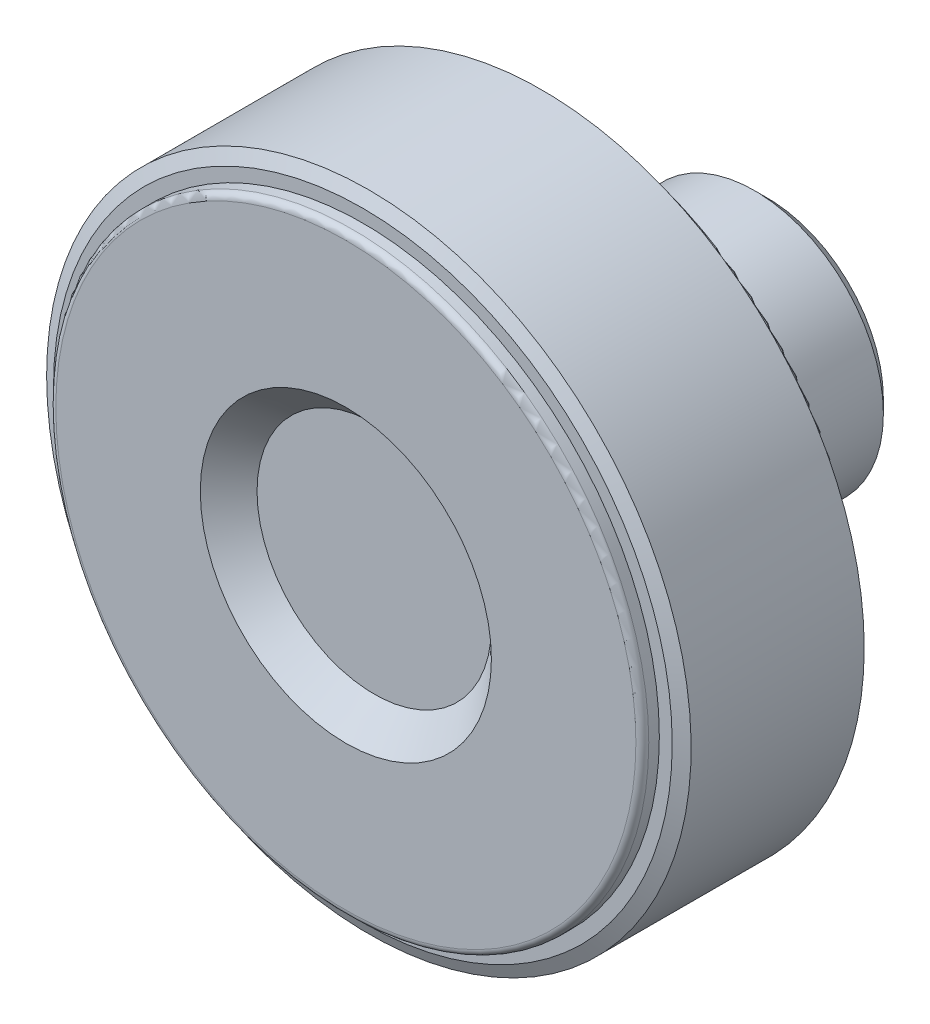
ISO-10303-21;
HEADER;
FILE_DESCRIPTION(('STEP AP214'),'2;1');
FILE_NAME('part.step','',(''),(''),'','','');
FILE_SCHEMA(('AUTOMOTIVE_DESIGN { 1 0 10303 214 1 1 1 1 }'));
ENDSEC;
DATA;
#1=APPLICATION_CONTEXT('core data for automotive mechanical design processes');
#2=APPLICATION_PROTOCOL_DEFINITION('international standard','automotive_design',2000,#1);
#3=PRODUCT_CONTEXT('',#1,'mechanical');
#4=PRODUCT('Part','Part','',(#3));
#5=PRODUCT_RELATED_PRODUCT_CATEGORY('part','',(#4));
#6=PRODUCT_DEFINITION_FORMATION('','',#4);
#7=PRODUCT_DEFINITION_CONTEXT('part definition',#1,'design');
#8=PRODUCT_DEFINITION('design','',#6,#7);
#9=PRODUCT_DEFINITION_SHAPE('','',#8);
#10=(LENGTH_UNIT() NAMED_UNIT(*) SI_UNIT(.MILLI.,.METRE.));
#11=(NAMED_UNIT(*) PLANE_ANGLE_UNIT() SI_UNIT($,.RADIAN.));
#12=(NAMED_UNIT(*) SI_UNIT($,.STERADIAN.) SOLID_ANGLE_UNIT());
#13=UNCERTAINTY_MEASURE_WITH_UNIT(LENGTH_MEASURE(1.E-05),#10,'distance_accuracy_value','');
#14=(GEOMETRIC_REPRESENTATION_CONTEXT(3) GLOBAL_UNCERTAINTY_ASSIGNED_CONTEXT((#13)) GLOBAL_UNIT_ASSIGNED_CONTEXT((#10,
#11,#12)) REPRESENTATION_CONTEXT('',''));
#15=CARTESIAN_POINT('',(0.,0.,0.));
#16=DIRECTION('',(0.,0.,1.));
#17=DIRECTION('',(1.,0.,0.));
#18=AXIS2_PLACEMENT_3D('',#15,#16,#17);
#19=CARTESIAN_POINT('',(0.,2.66666666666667,0.));
#20=DIRECTION('',(0.,0.,-1.));
#21=DIRECTION('',(-1.,0.,0.));
#22=AXIS2_PLACEMENT_3D('',#19,#20,#21);
#23=PLANE('',#22);
#24=CARTESIAN_POINT('',(0.,0.,0.));
#25=DIRECTION('',(0.,0.,-1.));
#26=DIRECTION('',(-1.,0.,0.));
#27=AXIS2_PLACEMENT_3D('',#24,#25,#26);
#28=CIRCLE('',#27,4.49999999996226);
#29=CARTESIAN_POINT('',(-4.49999999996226,0.,0.));
#30=VERTEX_POINT('',#29);
#31=EDGE_CURVE('E9',#30,#30,#28,.F.);
#32=ORIENTED_EDGE('',*,*,#31,.T.);
#33=EDGE_LOOP('',(#32));
#34=FACE_BOUND('',#33,.T.);
#35=CARTESIAN_POINT('',(0.,0.,0.));
#36=DIRECTION('',(0.,0.,1.));
#37=DIRECTION('',(1.,0.,0.));
#38=AXIS2_PLACEMENT_3D('',#35,#36,#37);
#39=CIRCLE('',#38,5.33333333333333);
#40=CARTESIAN_POINT('',(5.33333333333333,0.,0.));
#41=VERTEX_POINT('',#40);
#42=EDGE_CURVE('E211',#41,#41,#39,.T.);
#43=ORIENTED_EDGE('',*,*,#42,.F.);
#44=EDGE_LOOP('',(#43));
#45=FACE_BOUND('',#44,.T.);
#46=ADVANCED_FACE('F14',(#34,#45),#23,.T.);
#47=CARTESIAN_POINT('',(0.,0.,0.15));
#48=DIRECTION('',(0.,0.,1.));
#49=DIRECTION('',(1.,0.,0.));
#50=AXIS2_PLACEMENT_3D('',#47,#48,#49);
#51=CYLINDRICAL_SURFACE('',#50,5.33333333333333);
#52=ORIENTED_EDGE('',*,*,#42,.T.);
#53=EDGE_LOOP('',(#52));
#54=FACE_BOUND('',#53,.T.);
#55=CARTESIAN_POINT('',(0.,0.,0.3));
#56=DIRECTION('',(0.,0.,1.));
#57=DIRECTION('',(1.,0.,0.));
#58=AXIS2_PLACEMENT_3D('',#55,#56,#57);
#59=CIRCLE('',#58,5.33333333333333);
#60=CARTESIAN_POINT('',(5.33333333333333,0.,0.3));
#61=VERTEX_POINT('',#60);
#62=EDGE_CURVE('E208',#61,#61,#59,.T.);
#63=ORIENTED_EDGE('',*,*,#62,.F.);
#64=EDGE_LOOP('',(#63));
#65=FACE_BOUND('',#64,.T.);
#66=ADVANCED_FACE('F410',(#54,#65),#51,.T.);
#67=CARTESIAN_POINT('',(0.,7.16666666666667,0.3));
#68=DIRECTION('',(0.,0.,-1.));
#69=DIRECTION('',(-1.,0.,0.));
#70=AXIS2_PLACEMENT_3D('',#67,#68,#69);
#71=PLANE('',#70);
#72=CARTESIAN_POINT('',(0.,0.,0.3));
#73=DIRECTION('',(0.,0.,1.));
#74=DIRECTION('',(1.,0.,0.));
#75=AXIS2_PLACEMENT_3D('',#72,#73,#74);
#76=CIRCLE('',#75,9.);
#77=CARTESIAN_POINT('',(9.,0.,0.3));
#78=VERTEX_POINT('',#77);
#79=EDGE_CURVE('E177',#78,#78,#76,.T.);
#80=ORIENTED_EDGE('',*,*,#79,.F.);
#81=EDGE_LOOP('',(#80));
#82=FACE_BOUND('',#81,.T.);
#83=ORIENTED_EDGE('',*,*,#62,.T.);
#84=EDGE_LOOP('',(#83));
#85=FACE_BOUND('',#84,.T.);
#86=ADVANCED_FACE('F415',(#82,#85),#71,.T.);
#87=CARTESIAN_POINT('',(0.,0.,1.3));
#88=DIRECTION('',(0.,0.,1.));
#89=DIRECTION('',(1.,0.,0.));
#90=AXIS2_PLACEMENT_3D('',#87,#88,#89);
#91=CONICAL_SURFACE('',#90,10.,0.785398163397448);
#92=ORIENTED_EDGE('',*,*,#79,.T.);
#93=EDGE_LOOP('',(#92));
#94=FACE_BOUND('',#93,.T.);
#95=CARTESIAN_POINT('',(0.,0.,1.3));
#96=DIRECTION('',(0.,0.,1.));
#97=DIRECTION('',(1.,0.,0.));
#98=AXIS2_PLACEMENT_3D('',#95,#96,#97);
#99=CIRCLE('',#98,10.);
#100=CARTESIAN_POINT('',(10.,0.,1.3));
#101=VERTEX_POINT('',#100);
#102=EDGE_CURVE('E174',#101,#101,#99,.T.);
#103=ORIENTED_EDGE('',*,*,#102,.F.);
#104=EDGE_LOOP('',(#103));
#105=FACE_BOUND('',#104,.T.);
#106=ADVANCED_FACE('F420',(#94,#105),#91,.T.);
#107=CARTESIAN_POINT('',(0.,0.,13.9));
#108=DIRECTION('',(0.,0.,1.));
#109=DIRECTION('',(1.,0.,0.));
#110=AXIS2_PLACEMENT_3D('',#107,#108,#109);
#111=CYLINDRICAL_SURFACE('',#110,10.);
#112=ORIENTED_EDGE('',*,*,#102,.T.);
#113=EDGE_LOOP('',(#112));
#114=FACE_BOUND('',#113,.T.);
#115=CARTESIAN_POINT('',(0.,0.,26.5));
#116=DIRECTION('',(0.,0.,-1.));
#117=DIRECTION('',(-1.,0.,0.));
#118=AXIS2_PLACEMENT_3D('',#115,#116,#117);
#119=CIRCLE('',#118,10.);
#120=CARTESIAN_POINT('',(-10.,0.,26.5));
#121=VERTEX_POINT('',#120);
#122=EDGE_CURVE('E77',#121,#121,#119,.T.);
#123=ORIENTED_EDGE('',*,*,#122,.T.);
#124=EDGE_LOOP('',(#123));
#125=FACE_BOUND('',#124,.T.);
#126=ADVANCED_FACE('F427',(#114,#125),#111,.T.);
#127=CARTESIAN_POINT('',(0.,0.,26.5));
#128=DIRECTION('',(0.,0.,-1.));
#129=DIRECTION('',(-1.,0.,0.));
#130=AXIS2_PLACEMENT_3D('',#127,#128,#129);
#131=TOROIDAL_SURFACE('',#130,11.,1.);
#132=CARTESIAN_POINT('',(0.,0.,27.5));
#133=DIRECTION('',(0.,0.,-1.));
#134=DIRECTION('',(1.,0.,0.));
#135=AXIS2_PLACEMENT_3D('',#132,#133,#134);
#136=CIRCLE('',#135,11.);
#137=CARTESIAN_POINT('',(-11.,0.,27.5));
#138=VERTEX_POINT('',#137);
#139=CARTESIAN_POINT('',(11.,0.,27.5));
#140=VERTEX_POINT('',#139);
#141=EDGE_CURVE('E70',#138,#140,#136,.F.);
#142=ORIENTED_EDGE('',*,*,#141,.F.);
#143=CARTESIAN_POINT('',(0.,0.,27.5));
#144=DIRECTION('',(0.,0.,-1.));
#145=DIRECTION('',(-1.,0.,0.));
#146=AXIS2_PLACEMENT_3D('',#143,#144,#145);
#147=CIRCLE('',#146,11.);
#148=CARTESIAN_POINT('',(0.,11.,27.5));
#149=VERTEX_POINT('',#148);
#150=EDGE_CURVE('E73',#149,#138,#147,.F.);
#151=ORIENTED_EDGE('',*,*,#150,.F.);
#152=CARTESIAN_POINT('',(0.,0.,27.5));
#153=DIRECTION('',(0.,0.,-1.));
#154=DIRECTION('',(0.,1.,0.));
#155=AXIS2_PLACEMENT_3D('',#152,#153,#154);
#156=CIRCLE('',#155,11.);
#157=EDGE_CURVE('E65',#140,#149,#156,.F.);
#158=ORIENTED_EDGE('',*,*,#157,.F.);
#159=EDGE_LOOP('',(#142,#151,#158));
#160=FACE_BOUND('',#159,.T.);
#161=ORIENTED_EDGE('',*,*,#122,.F.);
#162=EDGE_LOOP('',(#161));
#163=FACE_BOUND('',#162,.T.);
#164=ADVANCED_FACE('F68',(#160,#163),#131,.F.);
#165=CARTESIAN_POINT('',(0.,14.6153846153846,27.5));
#166=DIRECTION('',(0.,0.,-1.));
#167=DIRECTION('',(-1.,0.,0.));
#168=AXIS2_PLACEMENT_3D('',#165,#166,#167);
#169=PLANE('',#168);
#170=CARTESIAN_POINT('',(0.,0.,27.5));
#171=DIRECTION('',(0.,0.,1.));
#172=DIRECTION('',(-1.,0.,0.));
#173=AXIS2_PLACEMENT_3D('',#170,#171,#172);
#174=CIRCLE('',#173,18.2307692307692);
#175=CARTESIAN_POINT('',(18.2307692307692,0.,27.5));
#176=VERTEX_POINT('',#175);
#177=CARTESIAN_POINT('',(-18.2307692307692,0.,27.5));
#178=VERTEX_POINT('',#177);
#179=EDGE_CURVE('E83',#176,#178,#174,.F.);
#180=ORIENTED_EDGE('',*,*,#179,.T.);
#181=CARTESIAN_POINT('',(0.,0.,27.5));
#182=DIRECTION('',(0.,0.,1.));
#183=DIRECTION('',(0.,1.,0.));
#184=AXIS2_PLACEMENT_3D('',#181,#182,#183);
#185=CIRCLE('',#184,18.2307692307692);
#186=CARTESIAN_POINT('',(0.,18.2307692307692,27.5));
#187=VERTEX_POINT('',#186);
#188=EDGE_CURVE('E132',#178,#187,#185,.F.);
#189=ORIENTED_EDGE('',*,*,#188,.T.);
#190=CARTESIAN_POINT('',(0.,0.,27.5));
#191=DIRECTION('',(0.,0.,1.));
#192=DIRECTION('',(1.,0.,0.));
#193=AXIS2_PLACEMENT_3D('',#190,#191,#192);
#194=CIRCLE('',#193,18.2307692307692);
#195=EDGE_CURVE('E145',#187,#176,#194,.F.);
#196=ORIENTED_EDGE('',*,*,#195,.T.);
#197=EDGE_LOOP('',(#180,#189,#196));
#198=FACE_BOUND('',#197,.T.);
#199=ORIENTED_EDGE('',*,*,#150,.T.);
#200=ORIENTED_EDGE('',*,*,#141,.T.);
#201=ORIENTED_EDGE('',*,*,#157,.T.);
#202=EDGE_LOOP('',(#199,#200,#201));
#203=FACE_BOUND('',#202,.T.);
#204=ADVANCED_FACE('F81',(#198,#203),#169,.T.);
#205=CARTESIAN_POINT('',(0.,0.,26.5));
#206=DIRECTION('',(0.,0.,-1.));
#207=DIRECTION('',(-1.,0.,0.));
#208=AXIS2_PLACEMENT_3D('',#205,#206,#207);
#209=TOROIDAL_SURFACE('',#208,18.2307692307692,1.);
#210=ORIENTED_EDGE('',*,*,#188,.F.);
#211=ORIENTED_EDGE('',*,*,#179,.F.);
#212=ORIENTED_EDGE('',*,*,#195,.F.);
#213=EDGE_LOOP('',(#210,#211,#212));
#214=FACE_BOUND('',#213,.T.);
#215=CARTESIAN_POINT('',(0.,0.,26.5));
#216=DIRECTION('',(0.,0.,1.));
#217=DIRECTION('',(1.,0.,0.));
#218=AXIS2_PLACEMENT_3D('',#215,#216,#217);
#219=CIRCLE('',#218,19.2307692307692);
#220=CARTESIAN_POINT('',(19.2307692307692,0.,26.5));
#221=VERTEX_POINT('',#220);
#222=EDGE_CURVE('E205',#221,#221,#219,.F.);
#223=ORIENTED_EDGE('',*,*,#222,.T.);
#224=EDGE_LOOP('',(#223));
#225=FACE_BOUND('',#224,.T.);
#226=ADVANCED_FACE('F102',(#214,#225),#209,.F.);
#227=CARTESIAN_POINT('',(0.,0.,21.25));
#228=DIRECTION('',(0.,0.,1.));
#229=DIRECTION('',(1.,0.,0.));
#230=AXIS2_PLACEMENT_3D('',#227,#228,#229);
#231=CYLINDRICAL_SURFACE('',#230,19.2307692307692);
#232=ORIENTED_EDGE('',*,*,#222,.F.);
#233=EDGE_LOOP('',(#232));
#234=FACE_BOUND('',#233,.T.);
#235=CARTESIAN_POINT('',(0.,0.,16.));
#236=DIRECTION('',(0.,0.,1.));
#237=DIRECTION('',(1.,0.,0.));
#238=AXIS2_PLACEMENT_3D('',#235,#236,#237);
#239=CIRCLE('',#238,19.2307692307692);
#240=CARTESIAN_POINT('',(19.2307692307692,0.,16.));
#241=VERTEX_POINT('',#240);
#242=EDGE_CURVE('E201',#241,#241,#239,.T.);
#243=ORIENTED_EDGE('',*,*,#242,.F.);
#244=EDGE_LOOP('',(#243));
#245=FACE_BOUND('',#244,.T.);
#246=ADVANCED_FACE('F326',(#234,#245),#231,.F.);
#247=CARTESIAN_POINT('',(0.,20.8653846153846,16.));
#248=DIRECTION('',(0.,0.,-1.));
#249=DIRECTION('',(-1.,0.,0.));
#250=AXIS2_PLACEMENT_3D('',#247,#248,#249);
#251=PLANE('',#250);
#252=CARTESIAN_POINT('',(0.,0.,16.));
#253=DIRECTION('',(0.,0.,1.));
#254=DIRECTION('',(-1.,0.,0.));
#255=AXIS2_PLACEMENT_3D('',#252,#253,#254);
#256=CIRCLE('',#255,22.5);
#257=CARTESIAN_POINT('',(-22.5,0.,16.));
#258=VERTEX_POINT('',#257);
#259=CARTESIAN_POINT('',(22.5,0.,16.));
#260=VERTEX_POINT('',#259);
#261=EDGE_CURVE('E261',#258,#260,#256,.T.);
#262=ORIENTED_EDGE('',*,*,#261,.F.);
#263=CARTESIAN_POINT('',(0.,0.,16.));
#264=DIRECTION('',(0.,0.,1.));
#265=DIRECTION('',(0.,1.,0.));
#266=AXIS2_PLACEMENT_3D('',#263,#264,#265);
#267=CIRCLE('',#266,22.5);
#268=CARTESIAN_POINT('',(0.,22.5,16.));
#269=VERTEX_POINT('',#268);
#270=EDGE_CURVE('E296',#269,#258,#267,.T.);
#271=ORIENTED_EDGE('',*,*,#270,.F.);
#272=CARTESIAN_POINT('',(0.,0.,16.));
#273=DIRECTION('',(0.,0.,1.));
#274=DIRECTION('',(1.,0.,0.));
#275=AXIS2_PLACEMENT_3D('',#272,#273,#274);
#276=CIRCLE('',#275,22.5);
#277=EDGE_CURVE('E204',#260,#269,#276,.T.);
#278=ORIENTED_EDGE('',*,*,#277,.F.);
#279=EDGE_LOOP('',(#262,#271,#278));
#280=FACE_BOUND('',#279,.T.);
#281=ORIENTED_EDGE('',*,*,#242,.T.);
#282=EDGE_LOOP('',(#281));
#283=FACE_BOUND('',#282,.T.);
#284=ADVANCED_FACE('F272',(#280,#283),#251,.T.);
#285=CARTESIAN_POINT('',(0.,0.,16.5));
#286=DIRECTION('',(0.,0.,-1.));
#287=DIRECTION('',(-1.,0.,0.));
#288=AXIS2_PLACEMENT_3D('',#285,#286,#287);
#289=TOROIDAL_SURFACE('',#288,22.5,0.5);
#290=ORIENTED_EDGE('',*,*,#270,.T.);
#291=ORIENTED_EDGE('',*,*,#261,.T.);
#292=ORIENTED_EDGE('',*,*,#277,.T.);
#293=EDGE_LOOP('',(#290,#291,#292));
#294=FACE_BOUND('',#293,.T.);
#295=CARTESIAN_POINT('',(0.,0.,16.5));
#296=DIRECTION('',(0.,0.,1.));
#297=DIRECTION('',(1.,0.,0.));
#298=AXIS2_PLACEMENT_3D('',#295,#296,#297);
#299=CIRCLE('',#298,23.);
#300=CARTESIAN_POINT('',(23.,0.,16.5));
#301=VERTEX_POINT('',#300);
#302=EDGE_CURVE('E200',#301,#301,#299,.T.);
#303=ORIENTED_EDGE('',*,*,#302,.F.);
#304=EDGE_LOOP('',(#303));
#305=FACE_BOUND('',#304,.T.);
#306=ADVANCED_FACE('F266',(#294,#305),#289,.T.);
#307=CARTESIAN_POINT('',(0.,0.,16.91));
#308=DIRECTION('',(0.,0.,1.));
#309=DIRECTION('',(1.,0.,0.));
#310=AXIS2_PLACEMENT_3D('',#307,#308,#309);
#311=CYLINDRICAL_SURFACE('',#310,23.);
#312=ORIENTED_EDGE('',*,*,#302,.T.);
#313=EDGE_LOOP('',(#312));
#314=FACE_BOUND('',#313,.T.);
#315=CARTESIAN_POINT('',(0.,0.,17.32));
#316=DIRECTION('',(0.,0.,1.));
#317=DIRECTION('',(1.,0.,0.));
#318=AXIS2_PLACEMENT_3D('',#315,#316,#317);
#319=CIRCLE('',#318,23.);
#320=CARTESIAN_POINT('',(23.,0.,17.32));
#321=VERTEX_POINT('',#320);
#322=EDGE_CURVE('E197',#321,#321,#319,.T.);
#323=ORIENTED_EDGE('',*,*,#322,.F.);
#324=EDGE_LOOP('',(#323));
#325=FACE_BOUND('',#324,.T.);
#326=ADVANCED_FACE('F271',(#314,#325),#311,.T.);
#327=CARTESIAN_POINT('',(0.,23.5,17.32));
#328=DIRECTION('',(0.,0.,-1.));
#329=DIRECTION('',(-1.,0.,0.));
#330=AXIS2_PLACEMENT_3D('',#327,#328,#329);
#331=PLANE('',#330);
#332=CARTESIAN_POINT('',(0.,0.,17.32));
#333=DIRECTION('',(0.,0.,1.));
#334=DIRECTION('',(1.,0.,0.));
#335=AXIS2_PLACEMENT_3D('',#332,#333,#334);
#336=CIRCLE('',#335,24.);
#337=CARTESIAN_POINT('',(24.,0.,17.32));
#338=VERTEX_POINT('',#337);
#339=EDGE_CURVE('E193',#338,#338,#336,.T.);
#340=ORIENTED_EDGE('',*,*,#339,.F.);
#341=EDGE_LOOP('',(#340));
#342=FACE_BOUND('',#341,.T.);
#343=ORIENTED_EDGE('',*,*,#322,.T.);
#344=EDGE_LOOP('',(#343));
#345=FACE_BOUND('',#344,.T.);
#346=ADVANCED_FACE('F340',(#342,#345),#331,.T.);
#347=CARTESIAN_POINT('',(0.,0.,17.786307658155));
#348=DIRECTION('',(0.,0.,1.));
#349=DIRECTION('',(1.,0.,0.));
#350=AXIS2_PLACEMENT_3D('',#347,#348,#349);
#351=CONICAL_SURFACE('',#350,25.,1.13446401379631);
#352=CARTESIAN_POINT('',(4.86721773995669E-13,1.73372427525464E-12,17.786307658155));
#353=DIRECTION('',(0.,0.,-1.));
#354=DIRECTION('',(-1.,0.,0.));
#355=AXIS2_PLACEMENT_3D('',#352,#353,#354);
#356=CIRCLE('',#355,24.9999999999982);
#357=CARTESIAN_POINT('',(-24.9999999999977,1.73372427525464E-12,17.786307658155));
#358=VERTEX_POINT('',#357);
#359=EDGE_CURVE('E196',#358,#358,#356,.F.);
#360=ORIENTED_EDGE('',*,*,#359,.F.);
#361=EDGE_LOOP('',(#360));
#362=FACE_BOUND('',#361,.T.);
#363=ORIENTED_EDGE('',*,*,#339,.T.);
#364=EDGE_LOOP('',(#363));
#365=FACE_BOUND('',#364,.T.);
#366=ADVANCED_FACE('F337',(#362,#365),#351,.T.);
#367=CARTESIAN_POINT('',(0.,0.,20.));
#368=DIRECTION('',(0.,0.,-1.));
#369=DIRECTION('',(-1.,0.,0.));
#370=AXIS2_PLACEMENT_3D('',#367,#368,#369);
#371=PLANE('',#370);
#372=CARTESIAN_POINT('',(0.,0.,20.));
#373=DIRECTION('',(0.,0.,-1.));
#374=DIRECTION('',(-1.,0.,0.));
#375=AXIS2_PLACEMENT_3D('',#372,#373,#374);
#376=CIRCLE('',#375,3.99999999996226);
#377=CARTESIAN_POINT('',(-3.99999999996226,0.,20.));
#378=VERTEX_POINT('',#377);
#379=EDGE_CURVE('E214',#378,#378,#376,.T.);
#380=ORIENTED_EDGE('',*,*,#379,.T.);
#381=EDGE_LOOP('',(#380));
#382=FACE_BOUND('',#381,.T.);
#383=ADVANCED_FACE('F339',(#382),#371,.T.);
#384=CARTESIAN_POINT('',(0.,0.,20.));
#385=DIRECTION('',(0.,0.,-1.));
#386=DIRECTION('',(-1.,0.,0.));
#387=AXIS2_PLACEMENT_3D('',#384,#385,#386);
#388=CYLINDRICAL_SURFACE('',#387,3.99999999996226);
#389=CARTESIAN_POINT('',(0.,0.,0.500000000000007));
#390=DIRECTION('',(0.,0.,-1.));
#391=DIRECTION('',(-1.,0.,0.));
#392=AXIS2_PLACEMENT_3D('',#389,#390,#391);
#393=CIRCLE('',#392,3.99999999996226);
#394=CARTESIAN_POINT('',(-3.99999999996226,0.,0.500000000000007));
#395=VERTEX_POINT('',#394);
#396=EDGE_CURVE('E24',#395,#395,#393,.T.);
#397=ORIENTED_EDGE('',*,*,#396,.T.);
#398=EDGE_LOOP('',(#397));
#399=FACE_BOUND('',#398,.T.);
#400=ORIENTED_EDGE('',*,*,#379,.F.);
#401=EDGE_LOOP('',(#400));
#402=FACE_BOUND('',#401,.T.);
#403=ADVANCED_FACE('F348',(#399,#402),#388,.F.);
#404=CARTESIAN_POINT('',(0.,0.,0.500000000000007));
#405=DIRECTION('',(0.,0.,-1.));
#406=DIRECTION('',(-1.,0.,0.));
#407=AXIS2_PLACEMENT_3D('',#404,#405,#406);
#408=CONICAL_SURFACE('',#407,3.99999999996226,0.785398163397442);
#409=ORIENTED_EDGE('',*,*,#31,.F.);
#410=EDGE_LOOP('',(#409));
#411=FACE_BOUND('',#410,.T.);
#412=ORIENTED_EDGE('',*,*,#396,.F.);
#413=EDGE_LOOP('',(#412));
#414=FACE_BOUND('',#413,.T.);
#415=ADVANCED_FACE('F16',(#411,#414),#408,.F.);
#416=CARTESIAN_POINT('',(0.,4.54545454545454,30.8));
#417=DIRECTION('',(0.,0.,1.));
#418=DIRECTION('',(1.,0.,0.));
#419=AXIS2_PLACEMENT_3D('',#416,#417,#418);
#420=PLANE('',#419);
#421=CARTESIAN_POINT('',(0.,0.,30.8));
#422=DIRECTION('',(0.,0.,1.));
#423=DIRECTION('',(1.,0.,0.));
#424=AXIS2_PLACEMENT_3D('',#421,#422,#423);
#425=CIRCLE('',#424,9.0909090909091);
#426=CARTESIAN_POINT('',(9.0909090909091,0.,30.8));
#427=VERTEX_POINT('',#426);
#428=EDGE_CURVE('E181',#427,#427,#425,.T.);
#429=ORIENTED_EDGE('',*,*,#428,.T.);
#430=EDGE_LOOP('',(#429));
#431=FACE_BOUND('',#430,.T.);
#432=ADVANCED_FACE('F239',(#431),#420,.T.);
#433=CARTESIAN_POINT('',(0.,0.,33.));
#434=DIRECTION('',(0.,0.,1.));
#435=DIRECTION('',(1.,0.,0.));
#436=AXIS2_PLACEMENT_3D('',#433,#434,#435);
#437=CONICAL_SURFACE('',#436,11.2909090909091,0.785398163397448);
#438=CARTESIAN_POINT('',(0.,0.,33.));
#439=DIRECTION('',(0.,0.,1.));
#440=DIRECTION('',(1.,0.,0.));
#441=AXIS2_PLACEMENT_3D('',#438,#439,#440);
#442=CIRCLE('',#441,11.2909090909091);
#443=CARTESIAN_POINT('',(11.2909090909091,0.,33.));
#444=VERTEX_POINT('',#443);
#445=EDGE_CURVE('E178',#444,#444,#442,.F.);
#446=ORIENTED_EDGE('',*,*,#445,.F.);
#447=EDGE_LOOP('',(#446));
#448=FACE_BOUND('',#447,.T.);
#449=ORIENTED_EDGE('',*,*,#428,.F.);
#450=EDGE_LOOP('',(#449));
#451=FACE_BOUND('',#450,.T.);
#452=ADVANCED_FACE('F237',(#448,#451),#437,.F.);
#453=CARTESIAN_POINT('',(0.,16.8954545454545,33.));
#454=DIRECTION('',(0.,0.,1.));
#455=DIRECTION('',(1.,0.,0.));
#456=AXIS2_PLACEMENT_3D('',#453,#454,#455);
#457=PLANE('',#456);
#458=ORIENTED_EDGE('',*,*,#445,.T.);
#459=EDGE_LOOP('',(#458));
#460=FACE_BOUND('',#459,.T.);
#461=CARTESIAN_POINT('',(0.,0.,33.));
#462=DIRECTION('',(0.,0.,-1.));
#463=DIRECTION('',(-1.,0.,0.));
#464=AXIS2_PLACEMENT_3D('',#461,#462,#463);
#465=CIRCLE('',#464,22.5);
#466=CARTESIAN_POINT('',(0.,22.5,33.));
#467=VERTEX_POINT('',#466);
#468=CARTESIAN_POINT('',(-22.5,0.,33.));
#469=VERTEX_POINT('',#468);
#470=EDGE_CURVE('E216',#467,#469,#465,.F.);
#471=ORIENTED_EDGE('',*,*,#470,.T.);
#472=CARTESIAN_POINT('',(0.,0.,33.));
#473=DIRECTION('',(0.,0.,-1.));
#474=DIRECTION('',(1.,0.,0.));
#475=AXIS2_PLACEMENT_3D('',#472,#473,#474);
#476=CIRCLE('',#475,22.5);
#477=CARTESIAN_POINT('',(22.5,0.,33.));
#478=VERTEX_POINT('',#477);
#479=EDGE_CURVE('E33',#469,#478,#476,.F.);
#480=ORIENTED_EDGE('',*,*,#479,.T.);
#481=CARTESIAN_POINT('',(0.,0.,33.));
#482=DIRECTION('',(0.,0.,-1.));
#483=DIRECTION('',(0.,1.,0.));
#484=AXIS2_PLACEMENT_3D('',#481,#482,#483);
#485=CIRCLE('',#484,22.5);
#486=EDGE_CURVE('E184',#478,#467,#485,.F.);
#487=ORIENTED_EDGE('',*,*,#486,.T.);
#488=EDGE_LOOP('',(#471,#480,#487));
#489=FACE_BOUND('',#488,.T.);
#490=ADVANCED_FACE('F235',(#460,#489),#457,.T.);
#491=CARTESIAN_POINT('',(0.,0.,32.5));
#492=DIRECTION('',(0.,0.,-1.));
#493=DIRECTION('',(-1.,0.,0.));
#494=AXIS2_PLACEMENT_3D('',#491,#492,#493);
#495=TOROIDAL_SURFACE('',#494,22.5,0.5);
#496=CARTESIAN_POINT('',(0.,0.,32.5));
#497=DIRECTION('',(0.,0.,-1.));
#498=DIRECTION('',(-1.,0.,0.));
#499=AXIS2_PLACEMENT_3D('',#496,#497,#498);
#500=CIRCLE('',#499,23.);
#501=CARTESIAN_POINT('',(-23.,0.,32.5));
#502=VERTEX_POINT('',#501);
#503=EDGE_CURVE('E185',#502,#502,#500,.F.);
#504=ORIENTED_EDGE('',*,*,#503,.T.);
#505=EDGE_LOOP('',(#504));
#506=FACE_BOUND('',#505,.T.);
#507=ORIENTED_EDGE('',*,*,#479,.F.);
#508=ORIENTED_EDGE('',*,*,#470,.F.);
#509=ORIENTED_EDGE('',*,*,#486,.F.);
#510=EDGE_LOOP('',(#507,#508,#509));
#511=FACE_BOUND('',#510,.T.);
#512=ADVANCED_FACE('F223',(#506,#511),#495,.T.);
#513=CARTESIAN_POINT('',(0.,0.,32.09));
#514=DIRECTION('',(0.,0.,1.));
#515=DIRECTION('',(1.,0.,0.));
#516=AXIS2_PLACEMENT_3D('',#513,#514,#515);
#517=CYLINDRICAL_SURFACE('',#516,23.);
#518=ORIENTED_EDGE('',*,*,#503,.F.);
#519=EDGE_LOOP('',(#518));
#520=FACE_BOUND('',#519,.T.);
#521=CARTESIAN_POINT('',(0.,0.,31.68));
#522=DIRECTION('',(0.,0.,1.));
#523=DIRECTION('',(1.,0.,0.));
#524=AXIS2_PLACEMENT_3D('',#521,#522,#523);
#525=CIRCLE('',#524,23.);
#526=CARTESIAN_POINT('',(23.,0.,31.68));
#527=VERTEX_POINT('',#526);
#528=EDGE_CURVE('E186',#527,#527,#525,.T.);
#529=ORIENTED_EDGE('',*,*,#528,.T.);
#530=EDGE_LOOP('',(#529));
#531=FACE_BOUND('',#530,.T.);
#532=ADVANCED_FACE('F234',(#520,#531),#517,.T.);
#533=CARTESIAN_POINT('',(0.,0.,31.213692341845));
#534=DIRECTION('',(0.,0.,-1.));
#535=DIRECTION('',(-1.,0.,0.));
#536=AXIS2_PLACEMENT_3D('',#533,#534,#535);
#537=CONICAL_SURFACE('',#536,25.,1.13446401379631);
#538=CARTESIAN_POINT('',(0.,0.,31.68));
#539=DIRECTION('',(0.,0.,-1.));
#540=DIRECTION('',(-1.,0.,0.));
#541=AXIS2_PLACEMENT_3D('',#538,#539,#540);
#542=CIRCLE('',#541,24.);
#543=CARTESIAN_POINT('',(-24.,0.,31.68));
#544=VERTEX_POINT('',#543);
#545=EDGE_CURVE('E189',#544,#544,#542,.F.);
#546=ORIENTED_EDGE('',*,*,#545,.F.);
#547=EDGE_LOOP('',(#546));
#548=FACE_BOUND('',#547,.T.);
#549=CARTESIAN_POINT('',(0.,0.,31.213692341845));
#550=DIRECTION('',(0.,0.,-1.));
#551=DIRECTION('',(0.,1.,0.));
#552=AXIS2_PLACEMENT_3D('',#549,#550,#551);
#553=CIRCLE('',#552,25.);
#554=CARTESIAN_POINT('',(0.,25.,31.213692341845));
#555=VERTEX_POINT('',#554);
#556=EDGE_CURVE('E192',#555,#555,#553,.F.);
#557=ORIENTED_EDGE('',*,*,#556,.T.);
#558=EDGE_LOOP('',(#557));
#559=FACE_BOUND('',#558,.T.);
#560=ADVANCED_FACE('F360',(#548,#559),#537,.T.);
#561=CARTESIAN_POINT('',(0.,23.5,31.68));
#562=DIRECTION('',(0.,0.,1.));
#563=DIRECTION('',(1.,0.,0.));
#564=AXIS2_PLACEMENT_3D('',#561,#562,#563);
#565=PLANE('',#564);
#566=ORIENTED_EDGE('',*,*,#528,.F.);
#567=EDGE_LOOP('',(#566));
#568=FACE_BOUND('',#567,.T.);
#569=ORIENTED_EDGE('',*,*,#545,.T.);
#570=EDGE_LOOP('',(#569));
#571=FACE_BOUND('',#570,.T.);
#572=ADVANCED_FACE('F358',(#568,#571),#565,.T.);
#573=CARTESIAN_POINT('',(4.86721773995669E-13,1.73372427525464E-12,0.));
#574=DIRECTION('',(0.,0.,-1.));
#575=DIRECTION('',(-1.,0.,0.));
#576=AXIS2_PLACEMENT_3D('',#573,#574,#575);
#577=CYLINDRICAL_SURFACE('',#576,24.9999999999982);
#578=ORIENTED_EDGE('',*,*,#359,.T.);
#579=EDGE_LOOP('',(#578));
#580=FACE_BOUND('',#579,.T.);
#581=ORIENTED_EDGE('',*,*,#556,.F.);
#582=EDGE_LOOP('',(#581));
#583=FACE_BOUND('',#582,.T.);
#584=ADVANCED_FACE('F355',(#580,#583),#577,.T.);
#585=CLOSED_SHELL('',(#46,#66,#86,#106,#126,#164,#204,#226,#246,#284,#306,#326,#346,#366,#383,
#403,#415,#432,#452,#490,#512,#532,#560,#572,#584));
#586=MANIFOLD_SOLID_BREP('B1',#585);
#587=ADVANCED_BREP_SHAPE_REPRESENTATION('',(#18,#586),#14);
#588=SHAPE_DEFINITION_REPRESENTATION(#9,#587);
ENDSEC;
END-ISO-10303-21;
